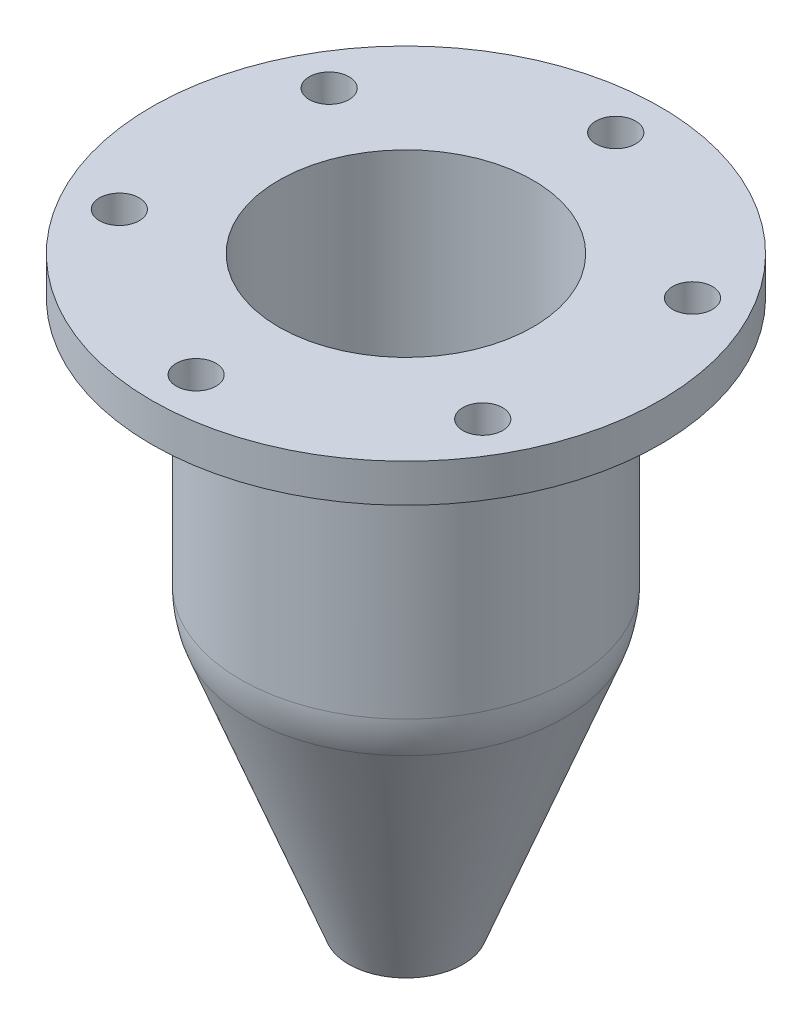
ISO-10303-21;
HEADER;
FILE_DESCRIPTION(('STEP AP214'),'2;1');
FILE_NAME('part.step','',(''),(''),'','','');
FILE_SCHEMA(('AUTOMOTIVE_DESIGN { 1 0 10303 214 1 1 1 1 }'));
ENDSEC;
DATA;
#1=APPLICATION_CONTEXT('core data for automotive mechanical design processes');
#2=APPLICATION_PROTOCOL_DEFINITION('international standard','automotive_design',2000,#1);
#3=PRODUCT_CONTEXT('',#1,'mechanical');
#4=PRODUCT('Part','Part','',(#3));
#5=PRODUCT_RELATED_PRODUCT_CATEGORY('part','',(#4));
#6=PRODUCT_DEFINITION_FORMATION('','',#4);
#7=PRODUCT_DEFINITION_CONTEXT('part definition',#1,'design');
#8=PRODUCT_DEFINITION('design','',#6,#7);
#9=PRODUCT_DEFINITION_SHAPE('','',#8);
#10=(LENGTH_UNIT() NAMED_UNIT(*) SI_UNIT(.MILLI.,.METRE.));
#11=(NAMED_UNIT(*) PLANE_ANGLE_UNIT() SI_UNIT($,.RADIAN.));
#12=(NAMED_UNIT(*) SI_UNIT($,.STERADIAN.) SOLID_ANGLE_UNIT());
#13=UNCERTAINTY_MEASURE_WITH_UNIT(LENGTH_MEASURE(1.E-05),#10,'distance_accuracy_value','');
#14=(GEOMETRIC_REPRESENTATION_CONTEXT(3) GLOBAL_UNCERTAINTY_ASSIGNED_CONTEXT((#13)) GLOBAL_UNIT_ASSIGNED_CONTEXT((#10,
#11,#12)) REPRESENTATION_CONTEXT('',''));
#15=CARTESIAN_POINT('',(0.,0.,0.));
#16=DIRECTION('',(0.,0.,1.));
#17=DIRECTION('',(1.,0.,0.));
#18=AXIS2_PLACEMENT_3D('',#15,#16,#17);
#19=CARTESIAN_POINT('',(-13.4885436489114,1.12928566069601,0.));
#20=DIRECTION('',(0.,-1.,0.));
#21=DIRECTION('',(0.,0.,-1.));
#22=AXIS2_PLACEMENT_3D('',#19,#20,#21);
#23=PLANE('',#22);
#24=CARTESIAN_POINT('',(0.,1.12928566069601,0.));
#25=DIRECTION('',(0.,1.,0.));
#26=DIRECTION('',(0.,0.,1.));
#27=AXIS2_PLACEMENT_3D('',#24,#25,#26);
#28=CIRCLE('',#27,14.2875);
#29=CARTESIAN_POINT('',(0.,1.12928566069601,14.2875));
#30=VERTEX_POINT('',#29);
#31=EDGE_CURVE('E80',#30,#30,#28,.T.);
#32=ORIENTED_EDGE('',*,*,#31,.F.);
#33=EDGE_LOOP('',(#32));
#34=FACE_BOUND('',#33,.T.);
#35=CARTESIAN_POINT('',(0.,1.129285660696,0.));
#36=DIRECTION('',(0.,1.,0.));
#37=DIRECTION('',(0.,0.,1.));
#38=AXIS2_PLACEMENT_3D('',#35,#36,#37);
#39=CIRCLE('',#38,6.72707419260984);
#40=CARTESIAN_POINT('',(0.,1.129285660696,6.72707419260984));
#41=VERTEX_POINT('',#40);
#42=EDGE_CURVE('E116',#41,#41,#39,.T.);
#43=ORIENTED_EDGE('',*,*,#42,.T.);
#44=EDGE_LOOP('',(#43));
#45=FACE_BOUND('',#44,.T.);
#46=ADVANCED_FACE('F36',(#34,#45),#23,.T.);
#47=CARTESIAN_POINT('',(0.,-4.71271433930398,0.));
#48=DIRECTION('',(0.,1.,0.));
#49=DIRECTION('',(0.,0.,1.));
#50=AXIS2_PLACEMENT_3D('',#47,#48,#49);
#51=CONICAL_SURFACE('',#50,5.27049999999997,0.244346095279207);
#52=CARTESIAN_POINT('',(0.,71.487285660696,0.));
#53=DIRECTION('',(0.,1.,0.));
#54=DIRECTION('',(0.,0.,1.));
#55=AXIS2_PLACEMENT_3D('',#52,#53,#54);
#56=CIRCLE('',#55,24.2692938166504);
#57=CARTESIAN_POINT('',(0.,71.487285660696,24.2692938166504));
#58=VERTEX_POINT('',#57);
#59=EDGE_CURVE('E47',#58,#58,#56,.T.);
#60=CARTESIAN_POINT('',(0.,1.129285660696,6.72707419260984));
#61=CARTESIAN_POINT('',(0.,1.86218149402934,6.90980564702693));
#62=CARTESIAN_POINT('',(0.,2.59507732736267,7.09253710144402));
#63=CARTESIAN_POINT('',(0.,4.06086899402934,7.4580000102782));
#64=CARTESIAN_POINT('',(0.,4.79376482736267,7.64073146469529));
#65=CARTESIAN_POINT('',(0.,6.25955649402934,8.00619437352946));
#66=CARTESIAN_POINT('',(0.,6.99245232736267,8.18892582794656));
#67=CARTESIAN_POINT('',(0.,8.45824399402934,8.55438873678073));
#68=CARTESIAN_POINT('',(0.,9.19113982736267,8.73712019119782));
#69=CARTESIAN_POINT('',(0.,10.6569314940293,9.102583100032));
#70=CARTESIAN_POINT('',(0.,11.3898273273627,9.28531455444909));
#71=CARTESIAN_POINT('',(0.,12.8556189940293,9.65077746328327));
#72=CARTESIAN_POINT('',(0.,13.5885148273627,9.83350891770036));
#73=CARTESIAN_POINT('',(0.,15.0543064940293,10.1989718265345));
#74=CARTESIAN_POINT('',(0.,15.7872023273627,10.3817032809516));
#75=CARTESIAN_POINT('',(0.,17.2529939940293,10.7471661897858));
#76=CARTESIAN_POINT('',(0.,17.9858898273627,10.9298976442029));
#77=CARTESIAN_POINT('',(0.,19.4516814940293,11.2953605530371));
#78=CARTESIAN_POINT('',(0.,20.1845773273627,11.4780920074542));
#79=CARTESIAN_POINT('',(0.,21.6503689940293,11.8435549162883));
#80=CARTESIAN_POINT('',(0.,22.3832648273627,12.0262863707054));
#81=CARTESIAN_POINT('',(0.,23.8490564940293,12.3917492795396));
#82=CARTESIAN_POINT('',(0.,24.5819523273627,12.5744807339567));
#83=CARTESIAN_POINT('',(0.,26.0477439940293,12.9399436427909));
#84=CARTESIAN_POINT('',(0.,26.7806398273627,13.122675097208));
#85=CARTESIAN_POINT('',(0.,28.2464314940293,13.4881380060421));
#86=CARTESIAN_POINT('',(0.,28.9793273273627,13.6708694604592));
#87=CARTESIAN_POINT('',(0.,30.4451189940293,14.0363323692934));
#88=CARTESIAN_POINT('',(0.,31.1780148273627,14.2190638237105));
#89=CARTESIAN_POINT('',(0.,32.6438064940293,14.5845267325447));
#90=CARTESIAN_POINT('',(0.,33.3767023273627,14.7672581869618));
#91=CARTESIAN_POINT('',(0.,34.8424939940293,15.132721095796));
#92=CARTESIAN_POINT('',(0.,35.5753898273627,15.315452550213));
#93=CARTESIAN_POINT('',(0.,37.0411814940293,15.6809154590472));
#94=CARTESIAN_POINT('',(0.,37.7740773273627,15.8636469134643));
#95=CARTESIAN_POINT('',(0.,39.2398689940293,16.2291098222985));
#96=CARTESIAN_POINT('',(0.,39.9727648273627,16.4118412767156));
#97=CARTESIAN_POINT('',(0.,41.4385564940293,16.7773041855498));
#98=CARTESIAN_POINT('',(0.,42.1714523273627,16.9600356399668));
#99=CARTESIAN_POINT('',(0.,43.6372439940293,17.325498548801));
#100=CARTESIAN_POINT('',(0.,44.3701398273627,17.5082300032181));
#101=CARTESIAN_POINT('',(0.,45.8359314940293,17.8736929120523));
#102=CARTESIAN_POINT('',(0.,46.5688273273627,18.0564243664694));
#103=CARTESIAN_POINT('',(0.,48.0346189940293,18.4218872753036));
#104=CARTESIAN_POINT('',(0.,48.7675148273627,18.6046187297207));
#105=CARTESIAN_POINT('',(0.,50.2333064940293,18.9700816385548));
#106=CARTESIAN_POINT('',(0.,50.9662023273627,19.1528130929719));
#107=CARTESIAN_POINT('',(0.,52.4319939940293,19.5182760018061));
#108=CARTESIAN_POINT('',(0.,53.1648898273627,19.7010074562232));
#109=CARTESIAN_POINT('',(0.,54.6306814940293,20.0664703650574));
#110=CARTESIAN_POINT('',(0.,55.3635773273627,20.2492018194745));
#111=CARTESIAN_POINT('',(0.,56.8293689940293,20.6146647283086));
#112=CARTESIAN_POINT('',(0.,57.5622648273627,20.7973961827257));
#113=CARTESIAN_POINT('',(0.,59.0280564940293,21.1628590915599));
#114=CARTESIAN_POINT('',(0.,59.7609523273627,21.345590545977));
#115=CARTESIAN_POINT('',(0.,61.2267439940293,21.7110534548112));
#116=CARTESIAN_POINT('',(0.,61.9596398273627,21.8937849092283));
#117=CARTESIAN_POINT('',(0.,63.4254314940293,22.2592478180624));
#118=CARTESIAN_POINT('',(0.,64.1583273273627,22.4419792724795));
#119=CARTESIAN_POINT('',(0.,65.6241189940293,22.8074421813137));
#120=CARTESIAN_POINT('',(0.,66.3570148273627,22.9901736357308));
#121=CARTESIAN_POINT('',(0.,67.8228064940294,23.355636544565));
#122=CARTESIAN_POINT('',(0.,68.5557023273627,23.5383679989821));
#123=CARTESIAN_POINT('',(0.,70.0214939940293,23.9038309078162));
#124=CARTESIAN_POINT('',(0.,70.7543898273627,24.0865623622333));
#125=CARTESIAN_POINT('',(0.,71.487285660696,24.2692938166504));
#126=B_SPLINE_CURVE_WITH_KNOTS('',3,(#60,#61,#62,#63,#64,#65,#66,#67,#68,#69,#70,#71,#72,#73,
#74,#75,#76,#77,#78,#79,#80,#81,#82,#83,#84,#85,#86,#87,#88,#89,#90,#91,#92,#93,#94,#95,#96,#97,
#98,#99,#100,#101,#102,#103,#104,#105,#106,#107,#108,#109,#110,#111,#112,#113,#114,#115,#116,
#117,#118,#119,#120,#121,#122,#123,#124,#125),.UNSPECIFIED.,.F.,.F.,(4,2,2,2,2,2,2,2,2,2,2,2,2,
2,2,2,2,2,2,2,2,2,2,2,2,2,2,2,2,2,2,2,4),(0.,2.26599730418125,4.53199460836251,6.79799191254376,
9.06398921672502,11.3299865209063,13.5959838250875,15.8619811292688,18.12797843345,
20.3939757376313,22.6599730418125,24.9259703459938,27.1919676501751,29.4579649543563,
31.7239622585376,33.9899595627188,36.2559568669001,38.5219541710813,40.7879514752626,
43.0539487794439,45.3199460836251,47.5859433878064,49.8519406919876,52.1179379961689,
54.3839353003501,56.6499326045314,58.9159299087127,61.1819272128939,63.4479245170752,
65.7139218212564,67.9799191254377,70.2459164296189,72.5119137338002),.UNSPECIFIED.);
#127=EDGE_CURVE('BSEAM121',#41,#58,#126,.T.);
#128=ORIENTED_EDGE('',*,*,#42,.F.);
#129=ORIENTED_EDGE('',*,*,#59,.T.);
#130=ORIENTED_EDGE('',*,*,#127,.T.);
#131=ORIENTED_EDGE('',*,*,#127,.F.);
#132=EDGE_LOOP('',(#128,#130,#129,#131));
#133=FACE_BOUND('',#132,.T.);
#134=ADVANCED_FACE('F121',(#133),#51,.F.);
#135=CARTESIAN_POINT('',(-24.2692938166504,71.487285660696,0.));
#136=DIRECTION('',(0.,1.,0.));
#137=DIRECTION('',(0.,0.,1.));
#138=AXIS2_PLACEMENT_3D('',#135,#136,#137);
#139=PLANE('',#138);
#140=CARTESIAN_POINT('',(0.,71.487285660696,0.));
#141=DIRECTION('',(0.,1.,0.));
#142=DIRECTION('',(0.,0.,1.));
#143=AXIS2_PLACEMENT_3D('',#140,#141,#142);
#144=CIRCLE('',#143,31.75);
#145=CARTESIAN_POINT('',(0.,71.487285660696,31.75));
#146=VERTEX_POINT('',#145);
#147=EDGE_CURVE('E51',#146,#146,#144,.T.);
#148=ORIENTED_EDGE('',*,*,#147,.T.);
#149=EDGE_LOOP('',(#148));
#150=FACE_BOUND('',#149,.T.);
#151=ORIENTED_EDGE('',*,*,#59,.F.);
#152=EDGE_LOOP('',(#151));
#153=FACE_BOUND('',#152,.T.);
#154=ADVANCED_FACE('F124',(#150,#153),#139,.T.);
#155=CARTESIAN_POINT('',(0.,210.342148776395,0.));
#156=DIRECTION('',(0.,1.,0.));
#157=DIRECTION('',(0.,0.,1.));
#158=AXIS2_PLACEMENT_3D('',#155,#156,#157);
#159=CYLINDRICAL_SURFACE('',#158,31.75);
#160=CARTESIAN_POINT('',(0.,147.687285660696,0.));
#161=DIRECTION('',(0.,1.,0.));
#162=DIRECTION('',(0.,0.,1.));
#163=AXIS2_PLACEMENT_3D('',#160,#161,#162);
#164=CIRCLE('',#163,31.75);
#165=CARTESIAN_POINT('',(0.,147.687285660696,31.75));
#166=VERTEX_POINT('',#165);
#167=EDGE_CURVE('E84',#166,#166,#164,.T.);
#168=ORIENTED_EDGE('',*,*,#167,.T.);
#169=EDGE_LOOP('',(#168));
#170=FACE_BOUND('',#169,.T.);
#171=ORIENTED_EDGE('',*,*,#147,.F.);
#172=EDGE_LOOP('',(#171));
#173=FACE_BOUND('',#172,.T.);
#174=ADVANCED_FACE('F129',(#170,#173),#159,.F.);
#175=CARTESIAN_POINT('',(-31.75,147.687285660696,0.));
#176=DIRECTION('',(0.,1.,0.));
#177=DIRECTION('',(0.,0.,1.));
#178=AXIS2_PLACEMENT_3D('',#175,#176,#177);
#179=PLANE('',#178);
#180=CARTESIAN_POINT('',(45.368905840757,147.687285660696,26.1937500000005));
#181=DIRECTION('',(0.,1.,0.));
#182=DIRECTION('',(0.866025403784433,0.,0.50000000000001));
#183=AXIS2_PLACEMENT_3D('',#180,#181,#182);
#184=CIRCLE('',#183,4.9657);
#185=CARTESIAN_POINT('',(49.6693281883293,147.687285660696,28.6766000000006));
#186=VERTEX_POINT('',#185);
#187=EDGE_CURVE('E58',#186,#186,#184,.T.);
#188=ORIENTED_EDGE('',*,*,#187,.F.);
#189=EDGE_LOOP('',(#188));
#190=FACE_BOUND('',#189,.T.);
#191=CARTESIAN_POINT('',(45.3689058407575,147.687285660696,-26.1937499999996));
#192=DIRECTION('',(0.,1.,0.));
#193=DIRECTION('',(0.866025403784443,0.,-0.499999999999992));
#194=AXIS2_PLACEMENT_3D('',#191,#192,#193);
#195=CIRCLE('',#194,4.9657);
#196=CARTESIAN_POINT('',(49.6693281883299,147.687285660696,-28.6765999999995));
#197=VERTEX_POINT('',#196);
#198=EDGE_CURVE('E57',#197,#197,#195,.T.);
#199=ORIENTED_EDGE('',*,*,#198,.F.);
#200=EDGE_LOOP('',(#199));
#201=FACE_BOUND('',#200,.T.);
#202=CARTESIAN_POINT('',(3.65820169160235E-13,147.687285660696,-52.3875));
#203=DIRECTION('',(0.,1.,0.));
#204=DIRECTION('',(0.,0.,-1.));
#205=AXIS2_PLACEMENT_3D('',#202,#203,#204);
#206=CIRCLE('',#205,4.9657);
#207=CARTESIAN_POINT('',(4.00495487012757E-13,147.687285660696,-57.3532));
#208=VERTEX_POINT('',#207);
#209=EDGE_CURVE('E62',#208,#208,#206,.T.);
#210=ORIENTED_EDGE('',*,*,#209,.F.);
#211=EDGE_LOOP('',(#210));
#212=FACE_BOUND('',#211,.T.);
#213=CARTESIAN_POINT('',(-45.3689058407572,147.687285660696,-26.1937500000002));
#214=DIRECTION('',(0.,1.,0.));
#215=DIRECTION('',(-0.866025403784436,0.,-0.500000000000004));
#216=AXIS2_PLACEMENT_3D('',#213,#214,#215);
#217=CIRCLE('',#216,4.9657);
#218=CARTESIAN_POINT('',(-49.6693281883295,147.687285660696,-28.6766000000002));
#219=VERTEX_POINT('',#218);
#220=EDGE_CURVE('E67',#219,#219,#217,.T.);
#221=ORIENTED_EDGE('',*,*,#220,.F.);
#222=EDGE_LOOP('',(#221));
#223=FACE_BOUND('',#222,.T.);
#224=CARTESIAN_POINT('',(-45.3689058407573,147.687285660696,26.1937499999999));
#225=DIRECTION('',(0.,1.,0.));
#226=DIRECTION('',(-0.86602540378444,0.,0.499999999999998));
#227=AXIS2_PLACEMENT_3D('',#224,#225,#226);
#228=CIRCLE('',#227,4.9657);
#229=CARTESIAN_POINT('',(-49.6693281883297,147.687285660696,28.6765999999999));
#230=VERTEX_POINT('',#229);
#231=EDGE_CURVE('E72',#230,#230,#228,.T.);
#232=ORIENTED_EDGE('',*,*,#231,.F.);
#233=EDGE_LOOP('',(#232));
#234=FACE_BOUND('',#233,.T.);
#235=CARTESIAN_POINT('',(0.,147.687285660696,52.3875));
#236=DIRECTION('',(0.,1.,0.));
#237=DIRECTION('',(0.,0.,1.));
#238=AXIS2_PLACEMENT_3D('',#235,#236,#237);
#239=CIRCLE('',#238,4.9657);
#240=CARTESIAN_POINT('',(0.,147.687285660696,57.3532));
#241=VERTEX_POINT('',#240);
#242=EDGE_CURVE('E77',#241,#241,#239,.T.);
#243=ORIENTED_EDGE('',*,*,#242,.F.);
#244=EDGE_LOOP('',(#243));
#245=FACE_BOUND('',#244,.T.);
#246=CARTESIAN_POINT('',(0.,147.687285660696,0.));
#247=DIRECTION('',(0.,1.,0.));
#248=DIRECTION('',(0.,0.,1.));
#249=AXIS2_PLACEMENT_3D('',#246,#247,#248);
#250=CIRCLE('',#249,63.5);
#251=CARTESIAN_POINT('',(0.,147.687285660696,63.5));
#252=VERTEX_POINT('',#251);
#253=EDGE_CURVE('E88',#252,#252,#250,.T.);
#254=ORIENTED_EDGE('',*,*,#253,.T.);
#255=EDGE_LOOP('',(#254));
#256=FACE_BOUND('',#255,.T.);
#257=ORIENTED_EDGE('',*,*,#167,.F.);
#258=EDGE_LOOP('',(#257));
#259=FACE_BOUND('',#258,.T.);
#260=ADVANCED_FACE('F137',(#190,#201,#212,#223,#234,#245,#256,#259),#179,.T.);
#261=CARTESIAN_POINT('',(0.,210.342148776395,0.));
#262=DIRECTION('',(0.,1.,0.));
#263=DIRECTION('',(0.,0.,1.));
#264=AXIS2_PLACEMENT_3D('',#261,#262,#263);
#265=CYLINDRICAL_SURFACE('',#264,63.5);
#266=CARTESIAN_POINT('',(0.,138.162285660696,0.));
#267=DIRECTION('',(0.,1.,0.));
#268=DIRECTION('',(0.,0.,1.));
#269=AXIS2_PLACEMENT_3D('',#266,#267,#268);
#270=CIRCLE('',#269,63.5);
#271=CARTESIAN_POINT('',(0.,138.162285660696,63.5));
#272=VERTEX_POINT('',#271);
#273=EDGE_CURVE('E92',#272,#272,#270,.T.);
#274=ORIENTED_EDGE('',*,*,#273,.T.);
#275=EDGE_LOOP('',(#274));
#276=FACE_BOUND('',#275,.T.);
#277=ORIENTED_EDGE('',*,*,#253,.F.);
#278=EDGE_LOOP('',(#277));
#279=FACE_BOUND('',#278,.T.);
#280=ADVANCED_FACE('F166',(#276,#279),#265,.T.);
#281=CARTESIAN_POINT('',(-63.5,138.162285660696,0.));
#282=DIRECTION('',(0.,-1.,0.));
#283=DIRECTION('',(0.,0.,-1.));
#284=AXIS2_PLACEMENT_3D('',#281,#282,#283);
#285=PLANE('',#284);
#286=CARTESIAN_POINT('',(45.368905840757,138.162285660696,26.1937500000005));
#287=DIRECTION('',(0.,-1.,0.));
#288=DIRECTION('',(0.,0.,-1.));
#289=AXIS2_PLACEMENT_3D('',#286,#287,#288);
#290=CIRCLE('',#289,4.9657);
#291=CARTESIAN_POINT('',(45.368905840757,138.162285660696,21.2280500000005));
#292=VERTEX_POINT('',#291);
#293=EDGE_CURVE('E54',#292,#292,#290,.T.);
#294=ORIENTED_EDGE('',*,*,#293,.F.);
#295=EDGE_LOOP('',(#294));
#296=FACE_BOUND('',#295,.T.);
#297=CARTESIAN_POINT('',(45.3689058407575,138.162285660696,-26.1937499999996));
#298=DIRECTION('',(0.,-1.,0.));
#299=DIRECTION('',(0.,0.,-1.));
#300=AXIS2_PLACEMENT_3D('',#297,#298,#299);
#301=CIRCLE('',#300,4.9657);
#302=CARTESIAN_POINT('',(45.3689058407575,138.162285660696,-31.1594499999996));
#303=VERTEX_POINT('',#302);
#304=EDGE_CURVE('E59',#303,#303,#301,.T.);
#305=ORIENTED_EDGE('',*,*,#304,.F.);
#306=EDGE_LOOP('',(#305));
#307=FACE_BOUND('',#306,.T.);
#308=CARTESIAN_POINT('',(3.65820169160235E-13,138.162285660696,-52.3875));
#309=DIRECTION('',(0.,-1.,0.));
#310=DIRECTION('',(0.,0.,-1.));
#311=AXIS2_PLACEMENT_3D('',#308,#309,#310);
#312=CIRCLE('',#311,4.9657);
#313=CARTESIAN_POINT('',(3.65820169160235E-13,138.162285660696,-57.3532));
#314=VERTEX_POINT('',#313);
#315=EDGE_CURVE('E63',#314,#314,#312,.T.);
#316=ORIENTED_EDGE('',*,*,#315,.F.);
#317=EDGE_LOOP('',(#316));
#318=FACE_BOUND('',#317,.T.);
#319=CARTESIAN_POINT('',(-45.3689058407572,138.162285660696,-26.1937500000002));
#320=DIRECTION('',(0.,-1.,0.));
#321=DIRECTION('',(0.,0.,-1.));
#322=AXIS2_PLACEMENT_3D('',#319,#320,#321);
#323=CIRCLE('',#322,4.9657);
#324=CARTESIAN_POINT('',(-45.3689058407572,138.162285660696,-31.1594500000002));
#325=VERTEX_POINT('',#324);
#326=EDGE_CURVE('E68',#325,#325,#323,.T.);
#327=ORIENTED_EDGE('',*,*,#326,.F.);
#328=EDGE_LOOP('',(#327));
#329=FACE_BOUND('',#328,.T.);
#330=CARTESIAN_POINT('',(-45.3689058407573,138.162285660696,26.1937499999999));
#331=DIRECTION('',(0.,-1.,0.));
#332=DIRECTION('',(0.,0.,-1.));
#333=AXIS2_PLACEMENT_3D('',#330,#331,#332);
#334=CIRCLE('',#333,4.9657);
#335=CARTESIAN_POINT('',(-45.3689058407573,138.162285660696,21.2280499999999));
#336=VERTEX_POINT('',#335);
#337=EDGE_CURVE('E73',#336,#336,#334,.T.);
#338=ORIENTED_EDGE('',*,*,#337,.F.);
#339=EDGE_LOOP('',(#338));
#340=FACE_BOUND('',#339,.T.);
#341=CARTESIAN_POINT('',(0.,138.162285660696,52.3875));
#342=DIRECTION('',(0.,-1.,0.));
#343=DIRECTION('',(0.,0.,-1.));
#344=AXIS2_PLACEMENT_3D('',#341,#342,#343);
#345=CIRCLE('',#344,4.9657);
#346=CARTESIAN_POINT('',(0.,138.162285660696,47.4218));
#347=VERTEX_POINT('',#346);
#348=EDGE_CURVE('E78',#347,#347,#345,.T.);
#349=ORIENTED_EDGE('',*,*,#348,.F.);
#350=EDGE_LOOP('',(#349));
#351=FACE_BOUND('',#350,.T.);
#352=CARTESIAN_POINT('',(0.,138.162285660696,0.));
#353=DIRECTION('',(0.,1.,0.));
#354=DIRECTION('',(0.,0.,1.));
#355=AXIS2_PLACEMENT_3D('',#352,#353,#354);
#356=CIRCLE('',#355,41.275);
#357=CARTESIAN_POINT('',(0.,138.162285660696,41.275));
#358=VERTEX_POINT('',#357);
#359=EDGE_CURVE('E96',#358,#358,#356,.T.);
#360=ORIENTED_EDGE('',*,*,#359,.T.);
#361=EDGE_LOOP('',(#360));
#362=FACE_BOUND('',#361,.T.);
#363=ORIENTED_EDGE('',*,*,#273,.F.);
#364=EDGE_LOOP('',(#363));
#365=FACE_BOUND('',#364,.T.);
#366=ADVANCED_FACE('F160',(#296,#307,#318,#329,#340,#351,#362,#365),#285,.T.);
#367=CARTESIAN_POINT('',(0.,210.342148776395,0.));
#368=DIRECTION('',(0.,1.,0.));
#369=DIRECTION('',(0.,0.,1.));
#370=AXIS2_PLACEMENT_3D('',#367,#368,#369);
#371=CYLINDRICAL_SURFACE('',#370,41.275);
#372=CARTESIAN_POINT('',(0.,76.1915765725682,0.));
#373=DIRECTION('',(0.,-1.,0.));
#374=DIRECTION('',(0.,0.,-1.));
#375=AXIS2_PLACEMENT_3D('',#372,#373,#374);
#376=CIRCLE('',#375,41.275);
#377=CARTESIAN_POINT('',(0.,76.1915765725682,-41.275));
#378=VERTEX_POINT('',#377);
#379=EDGE_CURVE('E43',#378,#378,#376,.F.);
#380=ORIENTED_EDGE('',*,*,#379,.T.);
#381=EDGE_LOOP('',(#380));
#382=FACE_BOUND('',#381,.T.);
#383=ORIENTED_EDGE('',*,*,#359,.F.);
#384=EDGE_LOOP('',(#383));
#385=FACE_BOUND('',#384,.T.);
#386=ADVANCED_FACE('F150',(#382,#385),#371,.T.);
#387=CARTESIAN_POINT('',(0.,71.487285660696,0.));
#388=DIRECTION('',(0.,1.,0.));
#389=DIRECTION('',(0.,0.,1.));
#390=AXIS2_PLACEMENT_3D('',#387,#388,#389);
#391=CONICAL_SURFACE('',#390,41.275,0.366266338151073);
#392=CARTESIAN_POINT('',(0.,67.095025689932,0.));
#393=DIRECTION('',(0.,-1.,0.));
#394=DIRECTION('',(0.,0.,-1.));
#395=AXIS2_PLACEMENT_3D('',#392,#393,#394);
#396=CIRCLE('',#395,39.590243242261);
#397=CARTESIAN_POINT('',(0.,67.095025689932,-39.590243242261));
#398=VERTEX_POINT('',#397);
#399=EDGE_CURVE('E10',#398,#398,#396,.T.);
#400=ORIENTED_EDGE('',*,*,#399,.T.);
#401=EDGE_LOOP('',(#400));
#402=FACE_BOUND('',#401,.T.);
#403=ORIENTED_EDGE('',*,*,#31,.T.);
#404=EDGE_LOOP('',(#403));
#405=FACE_BOUND('',#404,.T.);
#406=ADVANCED_FACE('F147',(#402,#405),#391,.T.);
#407=CARTESIAN_POINT('',(0.,-30.112714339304,52.3875));
#408=DIRECTION('',(0.,1.,0.));
#409=DIRECTION('',(0.,0.,1.));
#410=AXIS2_PLACEMENT_3D('',#407,#408,#409);
#411=CYLINDRICAL_SURFACE('',#410,4.9657);
#412=ORIENTED_EDGE('',*,*,#348,.T.);
#413=EDGE_LOOP('',(#412));
#414=FACE_BOUND('',#413,.T.);
#415=ORIENTED_EDGE('',*,*,#242,.T.);
#416=EDGE_LOOP('',(#415));
#417=FACE_BOUND('',#416,.T.);
#418=ADVANCED_FACE('F149',(#414,#417),#411,.F.);
#419=CARTESIAN_POINT('',(-45.3689058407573,-30.112714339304,26.1937499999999));
#420=DIRECTION('',(0.,1.,0.));
#421=DIRECTION('',(0.,0.,1.));
#422=AXIS2_PLACEMENT_3D('',#419,#420,#421);
#423=CYLINDRICAL_SURFACE('',#422,4.9657);
#424=ORIENTED_EDGE('',*,*,#337,.T.);
#425=EDGE_LOOP('',(#424));
#426=FACE_BOUND('',#425,.T.);
#427=ORIENTED_EDGE('',*,*,#231,.T.);
#428=EDGE_LOOP('',(#427));
#429=FACE_BOUND('',#428,.T.);
#430=ADVANCED_FACE('F156',(#426,#429),#423,.F.);
#431=CARTESIAN_POINT('',(-45.3689058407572,-30.112714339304,-26.1937500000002));
#432=DIRECTION('',(0.,1.,0.));
#433=DIRECTION('',(0.,0.,1.));
#434=AXIS2_PLACEMENT_3D('',#431,#432,#433);
#435=CYLINDRICAL_SURFACE('',#434,4.9657);
#436=ORIENTED_EDGE('',*,*,#326,.T.);
#437=EDGE_LOOP('',(#436));
#438=FACE_BOUND('',#437,.T.);
#439=ORIENTED_EDGE('',*,*,#220,.T.);
#440=EDGE_LOOP('',(#439));
#441=FACE_BOUND('',#440,.T.);
#442=ADVANCED_FACE('F195',(#438,#441),#435,.F.);
#443=CARTESIAN_POINT('',(3.65820169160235E-13,-30.112714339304,-52.3875));
#444=DIRECTION('',(0.,1.,0.));
#445=DIRECTION('',(0.,0.,1.));
#446=AXIS2_PLACEMENT_3D('',#443,#444,#445);
#447=CYLINDRICAL_SURFACE('',#446,4.9657);
#448=ORIENTED_EDGE('',*,*,#315,.T.);
#449=EDGE_LOOP('',(#448));
#450=FACE_BOUND('',#449,.T.);
#451=ORIENTED_EDGE('',*,*,#209,.T.);
#452=EDGE_LOOP('',(#451));
#453=FACE_BOUND('',#452,.T.);
#454=ADVANCED_FACE('F200',(#450,#453),#447,.F.);
#455=CARTESIAN_POINT('',(45.3689058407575,-30.112714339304,-26.1937499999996));
#456=DIRECTION('',(0.,1.,0.));
#457=DIRECTION('',(0.,0.,1.));
#458=AXIS2_PLACEMENT_3D('',#455,#456,#457);
#459=CYLINDRICAL_SURFACE('',#458,4.9657);
#460=ORIENTED_EDGE('',*,*,#304,.T.);
#461=EDGE_LOOP('',(#460));
#462=FACE_BOUND('',#461,.T.);
#463=ORIENTED_EDGE('',*,*,#198,.T.);
#464=EDGE_LOOP('',(#463));
#465=FACE_BOUND('',#464,.T.);
#466=ADVANCED_FACE('F206',(#462,#465),#459,.F.);
#467=CARTESIAN_POINT('',(45.368905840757,-30.112714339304,26.1937500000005));
#468=DIRECTION('',(0.,1.,0.));
#469=DIRECTION('',(0.,0.,1.));
#470=AXIS2_PLACEMENT_3D('',#467,#468,#469);
#471=CYLINDRICAL_SURFACE('',#470,4.9657);
#472=ORIENTED_EDGE('',*,*,#293,.T.);
#473=EDGE_LOOP('',(#472));
#474=FACE_BOUND('',#473,.T.);
#475=ORIENTED_EDGE('',*,*,#187,.T.);
#476=EDGE_LOOP('',(#475));
#477=FACE_BOUND('',#476,.T.);
#478=ADVANCED_FACE('F210',(#474,#477),#471,.F.);
#479=CARTESIAN_POINT('',(0.,76.1915765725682,0.));
#480=DIRECTION('',(0.,-1.,0.));
#481=DIRECTION('',(0.,0.,-1.));
#482=AXIS2_PLACEMENT_3D('',#479,#480,#481);
#483=DEGENERATE_TOROIDAL_SURFACE('',#482,15.875,25.4,.T.);
#484=ORIENTED_EDGE('',*,*,#399,.F.);
#485=EDGE_LOOP('',(#484));
#486=FACE_BOUND('',#485,.T.);
#487=ORIENTED_EDGE('',*,*,#379,.F.);
#488=EDGE_LOOP('',(#487));
#489=FACE_BOUND('',#488,.T.);
#490=ADVANCED_FACE('F38',(#486,#489),#483,.T.);
#491=CLOSED_SHELL('',(#46,#134,#154,#174,#260,#280,#366,#386,#406,#418,#430,#442,#454,#466,#478,#490));
#492=MANIFOLD_SOLID_BREP('B2',#491);
#493=ADVANCED_BREP_SHAPE_REPRESENTATION('',(#18,#492),#14);
#494=SHAPE_DEFINITION_REPRESENTATION(#9,#493);
ENDSEC;
END-ISO-10303-21;
